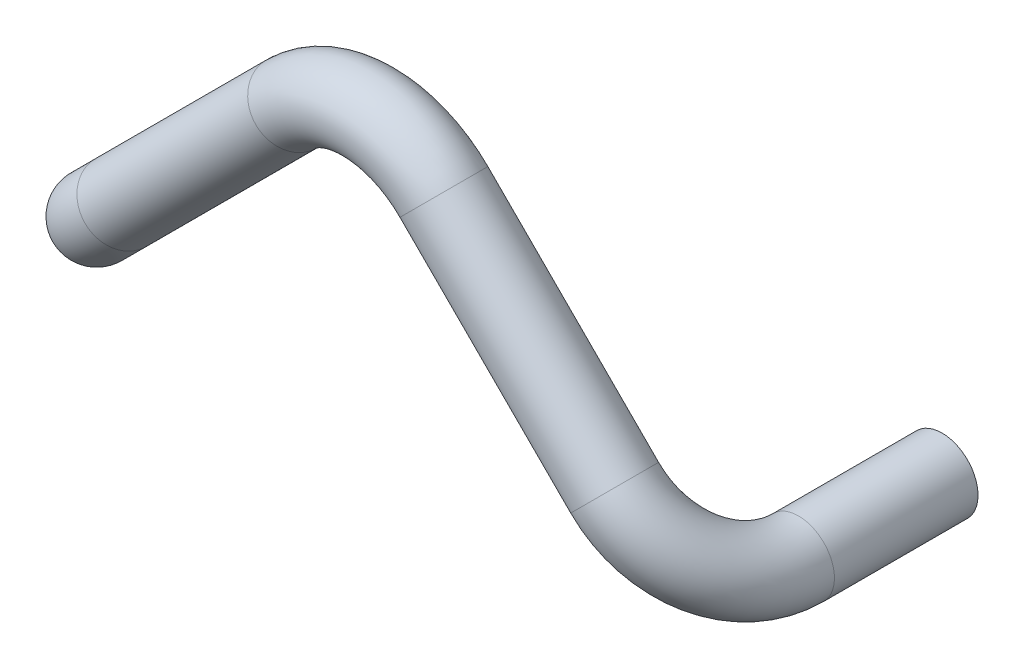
ISO-10303-21;
HEADER;
FILE_DESCRIPTION(('STEP AP214'),'2;1');
FILE_NAME('part.step','',(''),(''),'','','');
FILE_SCHEMA(('AUTOMOTIVE_DESIGN { 1 0 10303 214 1 1 1 1 }'));
ENDSEC;
DATA;
#1=APPLICATION_CONTEXT('core data for automotive mechanical design processes');
#2=APPLICATION_PROTOCOL_DEFINITION('international standard','automotive_design',2000,#1);
#3=PRODUCT_CONTEXT('',#1,'mechanical');
#4=PRODUCT('Part','Part','',(#3));
#5=PRODUCT_RELATED_PRODUCT_CATEGORY('part','',(#4));
#6=PRODUCT_DEFINITION_FORMATION('','',#4);
#7=PRODUCT_DEFINITION_CONTEXT('part definition',#1,'design');
#8=PRODUCT_DEFINITION('design','',#6,#7);
#9=PRODUCT_DEFINITION_SHAPE('','',#8);
#10=(LENGTH_UNIT() NAMED_UNIT(*) SI_UNIT(.MILLI.,.METRE.));
#11=(NAMED_UNIT(*) PLANE_ANGLE_UNIT() SI_UNIT($,.RADIAN.));
#12=(NAMED_UNIT(*) SI_UNIT($,.STERADIAN.) SOLID_ANGLE_UNIT());
#13=UNCERTAINTY_MEASURE_WITH_UNIT(LENGTH_MEASURE(1.E-05),#10,'distance_accuracy_value','');
#14=(GEOMETRIC_REPRESENTATION_CONTEXT(3) GLOBAL_UNCERTAINTY_ASSIGNED_CONTEXT((#13)) GLOBAL_UNIT_ASSIGNED_CONTEXT((#10,
#11,#12)) REPRESENTATION_CONTEXT('',''));
#15=CARTESIAN_POINT('',(0.,0.,0.));
#16=DIRECTION('',(0.,0.,1.));
#17=DIRECTION('',(1.,0.,0.));
#18=AXIS2_PLACEMENT_3D('',#15,#16,#17);
#19=CARTESIAN_POINT('',(90.,0.,0.));
#20=DIRECTION('',(0.,0.,1.));
#21=DIRECTION('',(-0.707106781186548,-0.707106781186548,0.));
#22=AXIS2_PLACEMENT_3D('',#19,#20,#21);
#23=PLANE('',#22);
#24=CARTESIAN_POINT('',(90.,0.,0.));
#25=DIRECTION('',(0.,0.,-1.));
#26=DIRECTION('',(0.707106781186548,0.707106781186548,0.));
#27=AXIS2_PLACEMENT_3D('',#24,#25,#26);
#28=CIRCLE('',#27,2.5);
#29=CARTESIAN_POINT('',(91.7677669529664,1.76776695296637,0.));
#30=VERTEX_POINT('',#29);
#31=EDGE_CURVE('E59',#30,#30,#28,.T.);
#32=ORIENTED_EDGE('',*,*,#31,.F.);
#33=EDGE_LOOP('',(#32));
#34=FACE_BOUND('',#33,.T.);
#35=CARTESIAN_POINT('',(90.,0.,0.));
#36=DIRECTION('',(0.,0.,1.));
#37=DIRECTION('',(-0.707106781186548,-0.707106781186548,0.));
#38=AXIS2_PLACEMENT_3D('',#35,#36,#37);
#39=CIRCLE('',#38,5.);
#40=CARTESIAN_POINT('',(86.4644660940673,-3.53553390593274,0.));
#41=VERTEX_POINT('',#40);
#42=EDGE_CURVE('E18',#41,#41,#39,.T.);
#43=ORIENTED_EDGE('',*,*,#42,.F.);
#44=EDGE_LOOP('',(#43));
#45=FACE_BOUND('',#44,.T.);
#46=ADVANCED_FACE('F15',(#34,#45),#23,.F.);
#47=CARTESIAN_POINT('',(90.,0.,10.));
#48=DIRECTION('',(0.,0.,-1.));
#49=DIRECTION('',(0.707106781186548,0.707106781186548,0.));
#50=AXIS2_PLACEMENT_3D('',#47,#48,#49);
#51=CYLINDRICAL_SURFACE('',#50,2.5);
#52=CARTESIAN_POINT('',(90.,0.,10.));
#53=DIRECTION('',(0.,0.,-1.));
#54=DIRECTION('',(0.707106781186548,0.707106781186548,0.));
#55=AXIS2_PLACEMENT_3D('',#52,#53,#54);
#56=CIRCLE('',#55,2.5);
#57=CARTESIAN_POINT('',(91.7677669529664,1.76776695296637,10.));
#58=VERTEX_POINT('',#57);
#59=EDGE_CURVE('E9',#58,#58,#56,.T.);
#60=ORIENTED_EDGE('',*,*,#59,.F.);
#61=EDGE_LOOP('',(#60));
#62=FACE_BOUND('',#61,.T.);
#63=ORIENTED_EDGE('',*,*,#31,.T.);
#64=EDGE_LOOP('',(#63));
#65=FACE_BOUND('',#64,.T.);
#66=ADVANCED_FACE('F68',(#62,#65),#51,.F.);
#67=CARTESIAN_POINT('',(90.,0.,0.));
#68=DIRECTION('',(0.,0.,1.));
#69=DIRECTION('',(-0.707106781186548,-0.707106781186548,0.));
#70=AXIS2_PLACEMENT_3D('',#67,#68,#69);
#71=CYLINDRICAL_SURFACE('',#70,5.);
#72=ORIENTED_EDGE('',*,*,#42,.T.);
#73=EDGE_LOOP('',(#72));
#74=FACE_BOUND('',#73,.T.);
#75=CARTESIAN_POINT('',(90.,0.,20.));
#76=DIRECTION('',(0.,0.,1.));
#77=DIRECTION('',(-0.707106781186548,-0.707106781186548,0.));
#78=AXIS2_PLACEMENT_3D('',#75,#76,#77);
#79=CIRCLE('',#78,5.);
#80=CARTESIAN_POINT('',(93.5355339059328,-3.53553390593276,20.));
#81=VERTEX_POINT('',#80);
#82=EDGE_CURVE('E57',#81,#81,#79,.T.);
#83=ORIENTED_EDGE('',*,*,#82,.F.);
#84=EDGE_LOOP('',(#83));
#85=FACE_BOUND('',#84,.T.);
#86=ADVANCED_FACE('F64',(#74,#85),#71,.T.);
#87=CARTESIAN_POINT('',(0.,0.,10.));
#88=DIRECTION('',(0.,0.,-1.));
#89=DIRECTION('',(-1.,0.,0.));
#90=AXIS2_PLACEMENT_3D('',#87,#88,#89);
#91=PLANE('',#90);
#92=ORIENTED_EDGE('',*,*,#59,.T.);
#93=EDGE_LOOP('',(#92));
#94=FACE_BOUND('',#93,.T.);
#95=ADVANCED_FACE('F67',(#94),#91,.T.);
#96=CARTESIAN_POINT('',(0.,0.,20.));
#97=DIRECTION('',(0.,0.,-1.));
#98=DIRECTION('',(0.707106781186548,0.707106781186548,0.));
#99=AXIS2_PLACEMENT_3D('',#96,#97,#98);
#100=CYLINDRICAL_SURFACE('',#99,5.);
#101=CARTESIAN_POINT('',(0.,0.,20.));
#102=DIRECTION('',(0.,0.,-1.));
#103=DIRECTION('',(0.707106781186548,-0.707106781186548,0.));
#104=AXIS2_PLACEMENT_3D('',#101,#102,#103);
#105=CIRCLE('',#104,5.);
#106=CARTESIAN_POINT('',(-3.53553390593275,-3.53553390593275,20.));
#107=VERTEX_POINT('',#106);
#108=EDGE_CURVE('E38',#107,#107,#105,.T.);
#109=ORIENTED_EDGE('',*,*,#108,.T.);
#110=EDGE_LOOP('',(#109));
#111=FACE_BOUND('',#110,.T.);
#112=CARTESIAN_POINT('',(0.,0.,0.));
#113=DIRECTION('',(0.,0.,-1.));
#114=DIRECTION('',(0.707106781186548,-0.707106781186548,0.));
#115=AXIS2_PLACEMENT_3D('',#112,#113,#114);
#116=CIRCLE('',#115,5.);
#117=CARTESIAN_POINT('',(3.53553390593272,-3.53553390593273,0.));
#118=VERTEX_POINT('',#117);
#119=EDGE_CURVE('E31',#118,#118,#116,.T.);
#120=ORIENTED_EDGE('',*,*,#119,.F.);
#121=EDGE_LOOP('',(#120));
#122=FACE_BOUND('',#121,.T.);
#123=ADVANCED_FACE('F74',(#111,#122),#100,.T.);
#124=CARTESIAN_POINT('',(79.3933982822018,10.6066017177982,20.));
#125=DIRECTION('',(-0.707106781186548,-0.707106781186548,0.));
#126=DIRECTION('',(0.,0.,-1.));
#127=AXIS2_PLACEMENT_3D('',#124,#125,#126);
#128=TOROIDAL_SURFACE('',#127,15.,5.);
#129=CARTESIAN_POINT('',(79.3933982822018,10.6066017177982,35.));
#130=DIRECTION('',(-0.707106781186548,0.707106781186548,0.));
#131=DIRECTION('',(-0.707106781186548,-0.707106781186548,0.));
#132=AXIS2_PLACEMENT_3D('',#129,#130,#131);
#133=CIRCLE('',#132,5.);
#134=CARTESIAN_POINT('',(79.3933982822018,10.6066017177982,40.));
#135=VERTEX_POINT('',#134);
#136=EDGE_CURVE('E54',#135,#135,#133,.T.);
#137=CARTESIAN_POINT('',(79.3933982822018,10.6066017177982,20.));
#138=DIRECTION('',(-0.707106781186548,-0.707106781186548,0.));
#139=DIRECTION('',(0.,0.,-1.));
#140=AXIS2_PLACEMENT_3D('',#137,#138,#139);
#141=CIRCLE('',#140,20.);
#142=EDGE_CURVE('',#81,#135,#141,.T.);
#143=ORIENTED_EDGE('',*,*,#82,.T.);
#144=ORIENTED_EDGE('',*,*,#136,.F.);
#145=ORIENTED_EDGE('',*,*,#142,.T.);
#146=ORIENTED_EDGE('',*,*,#142,.F.);
#147=EDGE_LOOP('',(#143,#145,#144,#146));
#148=FACE_BOUND('',#147,.T.);
#149=ADVANCED_FACE('F71',(#148),#128,.T.);
#150=CARTESIAN_POINT('',(79.3933982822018,10.6066017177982,35.));
#151=DIRECTION('',(-0.707106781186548,0.707106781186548,0.));
#152=DIRECTION('',(-0.707106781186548,-0.707106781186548,0.));
#153=AXIS2_PLACEMENT_3D('',#150,#151,#152);
#154=CYLINDRICAL_SURFACE('',#153,5.);
#155=CARTESIAN_POINT('',(55.6066017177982,34.3933982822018,35.));
#156=DIRECTION('',(-0.707106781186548,0.707106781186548,0.));
#157=DIRECTION('',(-0.707106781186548,-0.707106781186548,0.));
#158=AXIS2_PLACEMENT_3D('',#155,#156,#157);
#159=CIRCLE('',#158,5.);
#160=CARTESIAN_POINT('',(59.142135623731,37.9289321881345,35.));
#161=VERTEX_POINT('',#160);
#162=EDGE_CURVE('E51',#161,#161,#159,.T.);
#163=ORIENTED_EDGE('',*,*,#162,.F.);
#164=EDGE_LOOP('',(#163));
#165=FACE_BOUND('',#164,.T.);
#166=ORIENTED_EDGE('',*,*,#136,.T.);
#167=EDGE_LOOP('',(#166));
#168=FACE_BOUND('',#167,.T.);
#169=ADVANCED_FACE('F73',(#165,#168),#154,.T.);
#170=CARTESIAN_POINT('',(45.,23.7867965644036,35.));
#171=DIRECTION('',(0.,0.,1.));
#172=DIRECTION('',(-0.707106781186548,-0.707106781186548,0.));
#173=AXIS2_PLACEMENT_3D('',#170,#171,#172);
#174=TOROIDAL_SURFACE('',#173,15.,5.);
#175=CARTESIAN_POINT('',(34.3933982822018,34.3933982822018,35.));
#176=DIRECTION('',(-0.707106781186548,-0.707106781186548,0.));
#177=DIRECTION('',(0.707106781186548,-0.707106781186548,0.));
#178=AXIS2_PLACEMENT_3D('',#175,#176,#177);
#179=CIRCLE('',#178,5.);
#180=CARTESIAN_POINT('',(30.8578643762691,37.9289321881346,35.));
#181=VERTEX_POINT('',#180);
#182=EDGE_CURVE('E48',#181,#181,#179,.T.);
#183=CARTESIAN_POINT('',(45.,23.7867965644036,35.));
#184=DIRECTION('',(0.,0.,1.));
#185=DIRECTION('',(-0.707106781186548,-0.707106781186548,0.));
#186=AXIS2_PLACEMENT_3D('',#183,#184,#185);
#187=CIRCLE('',#186,20.);
#188=EDGE_CURVE('',#161,#181,#187,.T.);
#189=ORIENTED_EDGE('',*,*,#162,.T.);
#190=ORIENTED_EDGE('',*,*,#182,.F.);
#191=ORIENTED_EDGE('',*,*,#188,.T.);
#192=ORIENTED_EDGE('',*,*,#188,.F.);
#193=EDGE_LOOP('',(#189,#191,#190,#192));
#194=FACE_BOUND('',#193,.T.);
#195=ADVANCED_FACE('F83',(#194),#174,.T.);
#196=CARTESIAN_POINT('',(34.3933982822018,34.3933982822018,35.));
#197=DIRECTION('',(-0.707106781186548,-0.707106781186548,0.));
#198=DIRECTION('',(0.,0.,-1.));
#199=AXIS2_PLACEMENT_3D('',#196,#197,#198);
#200=CYLINDRICAL_SURFACE('',#199,5.);
#201=CARTESIAN_POINT('',(10.6066017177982,10.6066017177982,35.));
#202=DIRECTION('',(-0.707106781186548,-0.707106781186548,0.));
#203=DIRECTION('',(0.707106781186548,-0.707106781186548,0.));
#204=AXIS2_PLACEMENT_3D('',#201,#202,#203);
#205=CIRCLE('',#204,5.);
#206=CARTESIAN_POINT('',(10.6066017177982,10.6066017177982,40.));
#207=VERTEX_POINT('',#206);
#208=EDGE_CURVE('E45',#207,#207,#205,.T.);
#209=ORIENTED_EDGE('',*,*,#208,.F.);
#210=EDGE_LOOP('',(#209));
#211=FACE_BOUND('',#210,.T.);
#212=ORIENTED_EDGE('',*,*,#182,.T.);
#213=EDGE_LOOP('',(#212));
#214=FACE_BOUND('',#213,.T.);
#215=ADVANCED_FACE('F145',(#211,#214),#200,.T.);
#216=CARTESIAN_POINT('',(10.6066017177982,10.6066017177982,20.));
#217=DIRECTION('',(0.707106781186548,-0.707106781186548,0.));
#218=DIRECTION('',(0.,0.,1.));
#219=AXIS2_PLACEMENT_3D('',#216,#217,#218);
#220=TOROIDAL_SURFACE('',#219,15.,5.);
#221=CARTESIAN_POINT('',(10.6066017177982,10.6066017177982,20.));
#222=DIRECTION('',(0.707106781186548,-0.707106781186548,0.));
#223=DIRECTION('',(0.,0.,1.));
#224=AXIS2_PLACEMENT_3D('',#221,#222,#223);
#225=CIRCLE('',#224,20.);
#226=EDGE_CURVE('',#207,#107,#225,.T.);
#227=ORIENTED_EDGE('',*,*,#208,.T.);
#228=ORIENTED_EDGE('',*,*,#108,.F.);
#229=ORIENTED_EDGE('',*,*,#226,.T.);
#230=ORIENTED_EDGE('',*,*,#226,.F.);
#231=EDGE_LOOP('',(#227,#229,#228,#230));
#232=FACE_BOUND('',#231,.T.);
#233=ADVANCED_FACE('F88',(#232),#220,.T.);
#234=CARTESIAN_POINT('',(0.,0.,0.));
#235=DIRECTION('',(0.,0.,-1.));
#236=DIRECTION('',(0.707106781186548,-0.707106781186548,0.));
#237=AXIS2_PLACEMENT_3D('',#234,#235,#236);
#238=PLANE('',#237);
#239=CARTESIAN_POINT('',(0.,0.,0.));
#240=DIRECTION('',(0.,0.,-1.));
#241=DIRECTION('',(0.707106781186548,0.707106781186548,0.));
#242=AXIS2_PLACEMENT_3D('',#239,#240,#241);
#243=CIRCLE('',#242,2.5);
#244=CARTESIAN_POINT('',(1.76776695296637,1.76776695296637,0.));
#245=VERTEX_POINT('',#244);
#246=EDGE_CURVE('E34',#245,#245,#243,.T.);
#247=ORIENTED_EDGE('',*,*,#246,.F.);
#248=EDGE_LOOP('',(#247));
#249=FACE_BOUND('',#248,.T.);
#250=ORIENTED_EDGE('',*,*,#119,.T.);
#251=EDGE_LOOP('',(#250));
#252=FACE_BOUND('',#251,.T.);
#253=ADVANCED_FACE('F32',(#249,#252),#238,.T.);
#254=CARTESIAN_POINT('',(0.,0.,10.));
#255=DIRECTION('',(0.,0.,-1.));
#256=DIRECTION('',(0.707106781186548,0.707106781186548,0.));
#257=AXIS2_PLACEMENT_3D('',#254,#255,#256);
#258=CYLINDRICAL_SURFACE('',#257,2.5);
#259=CARTESIAN_POINT('',(0.,0.,10.));
#260=DIRECTION('',(0.,0.,-1.));
#261=DIRECTION('',(0.707106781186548,0.707106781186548,0.));
#262=AXIS2_PLACEMENT_3D('',#259,#260,#261);
#263=CIRCLE('',#262,2.5);
#264=CARTESIAN_POINT('',(1.76776695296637,1.76776695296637,10.));
#265=VERTEX_POINT('',#264);
#266=EDGE_CURVE('E35',#265,#265,#263,.T.);
#267=ORIENTED_EDGE('',*,*,#266,.F.);
#268=EDGE_LOOP('',(#267));
#269=FACE_BOUND('',#268,.T.);
#270=ORIENTED_EDGE('',*,*,#246,.T.);
#271=EDGE_LOOP('',(#270));
#272=FACE_BOUND('',#271,.T.);
#273=ADVANCED_FACE('F169',(#269,#272),#258,.F.);
#274=CARTESIAN_POINT('',(0.,0.,10.));
#275=DIRECTION('',(0.,0.,-1.));
#276=DIRECTION('',(-1.,0.,0.));
#277=AXIS2_PLACEMENT_3D('',#274,#275,#276);
#278=PLANE('',#277);
#279=ORIENTED_EDGE('',*,*,#266,.T.);
#280=EDGE_LOOP('',(#279));
#281=FACE_BOUND('',#280,.T.);
#282=ADVANCED_FACE('F178',(#281),#278,.T.);
#283=CLOSED_SHELL('',(#46,#66,#86,#95,#123,#149,#169,#195,#215,#233,#253,#273,#282));
#284=MANIFOLD_SOLID_BREP('B1',#283);
#285=ADVANCED_BREP_SHAPE_REPRESENTATION('',(#18,#284),#14);
#286=SHAPE_DEFINITION_REPRESENTATION(#9,#285);
ENDSEC;
END-ISO-10303-21;
